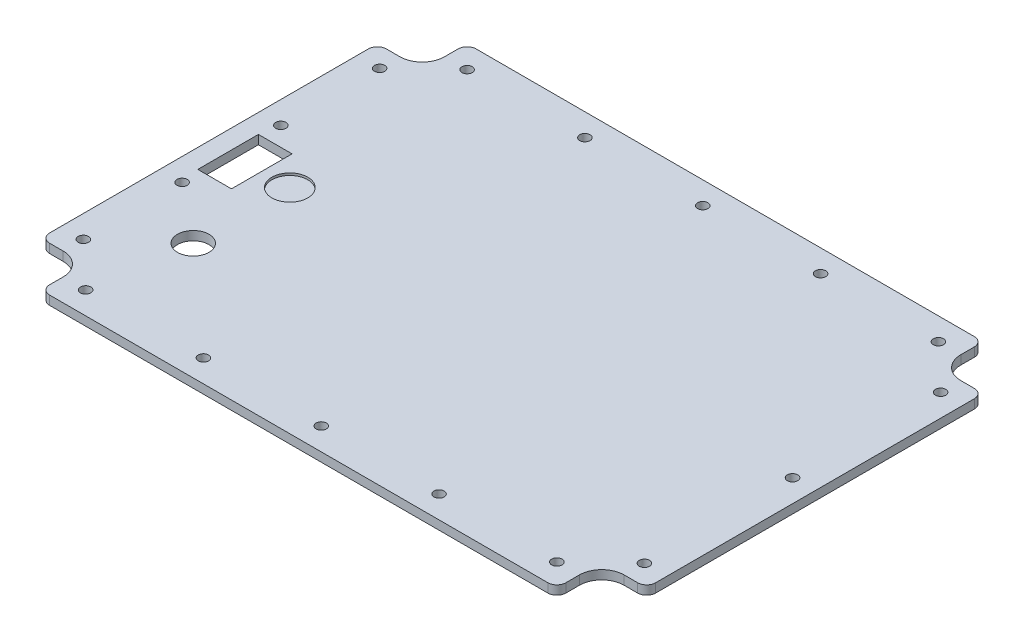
from build123d import *

# Parameters (mm, degrees)
ESQUISSE1_R             = 1.15
ESQUISSE1_R_2           = 3.5
ESQUISSE1_W             = 7.5
ESQUISSE1_H             = 13.5
BOSS_EXTRU_1_DEPTH      = 2
ESQUISSE3_R             = 4
ENL_V_MAT_EXTRU_1_DEPTH = 0.5


with BuildPart() as part:
    # Esquisse1 → Boss.-Extru.1 (new body)
    with BuildSketch(Plane(origin=(0, 0, 0), x_dir=(1, 0, 0), z_dir=(0, 1, 0))):
        with BuildLine():
            Line((-67.25, -36.072657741), (-67.25, 34.927342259))
            ThreePointArc((-67.25, 34.927342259), (-66.664213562, 36.341555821), (-65.25, 36.927342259))
            Line((-65.25, 36.927342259), (-62.25, 36.927342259))
            ThreePointArc((-62.25, 36.927342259), (-58.714466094, 38.391808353), (-57.25, 41.927342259))
            Line((-57.25, 41.927342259), (-57.25, 44.927342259))
            ThreePointArc((-57.25, 44.927342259), (-56.664213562, 46.341555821), (-55.25, 46.927342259))
            Line((-55.25, 46.927342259), (55.75, 46.927342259))
            ThreePointArc((55.75, 46.927342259), (57.164213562, 46.341555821), (57.75, 44.927342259))
            Line((57.75, 44.927342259), (57.75, 41.927342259))
            ThreePointArc((57.75, 41.927342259), (59.214466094, 38.391808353), (62.75, 36.927342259))
            Line((62.75, 36.927342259), (65.75, 36.927342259))
            ThreePointArc((65.75, 36.927342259), (67.164213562, 36.341555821), (67.75, 34.927342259))
            Line((67.75, 34.927342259), (67.75, -36.072657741))
            ThreePointArc((67.75, -36.072657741), (67.164213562, -37.486871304), (65.75, -38.072657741))
            Line((65.75, -38.072657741), (62.75, -38.072657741))
            ThreePointArc((62.75, -38.072657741), (59.214466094, -39.537123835), (57.75, -43.072657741))
            Line((57.75, -43.072657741), (57.75, -46.072657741))
            ThreePointArc((57.75, -46.072657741), (57.164213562, -47.486871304), (55.75, -48.072657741))
            Line((55.75, -48.072657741), (-55.25, -48.072657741))
            ThreePointArc((-55.25, -48.072657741), (-56.664213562, -47.486871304), (-57.25, -46.072657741))
            Line((-57.25, -46.072657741), (-57.25, -43.072657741))
            ThreePointArc((-57.25, -43.072657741), (-58.714466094, -39.537123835), (-62.25, -38.072657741))
            Line((-62.25, -38.072657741), (-65.25, -38.072657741))
            ThreePointArc((-65.25, -38.072657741), (-66.664213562, -37.486871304), (-67.25, -36.072657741))
        make_face()
        with Locations(Location((0.25, 41.927342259, 0), (0, 0, 270))):
            Circle(ESQUISSE1_R, mode=Mode.SUBTRACT)
        with Locations(Location((62.75, -0.572657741, 0), (0, 0, 270))):
            Circle(ESQUISSE1_R, mode=Mode.SUBTRACT)
        with Locations(Location((52.75, 41.927342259, 0), (0, 0, 90))):
            Circle(ESQUISSE1_R, mode=Mode.SUBTRACT)
        with Locations(Location((26.5, 41.927342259, 0), (0, 0, 90))):
            Circle(ESQUISSE1_R, mode=Mode.SUBTRACT)
        with Locations(Location((-52.25, -43.072657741, 0), (0, 0, 90))):
            Circle(ESQUISSE1_R, mode=Mode.SUBTRACT)
        with Locations(Location((-26, -43.072657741, 0), (0, 0, 90))):
            Circle(ESQUISSE1_R, mode=Mode.SUBTRACT)
        with Locations(Location((26.5, -43.072657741, 0), (0, 0, 270))):
            Circle(ESQUISSE1_R, mode=Mode.SUBTRACT)
        with Locations(Location((52.75, -43.072657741, 0), (0, 0, 270))):
            Circle(ESQUISSE1_R, mode=Mode.SUBTRACT)
        with Locations(Location((0.25, -43.072657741, 0), (0, 0, 90))):
            Circle(ESQUISSE1_R, mode=Mode.SUBTRACT)
        with Locations(Location((-62.25, 32.427342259, 0), (0, 0, 270))):
            Circle(ESQUISSE1_R, mode=Mode.SUBTRACT)
        with Locations(Location((-62.25, 10.427342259, 0), (0, 0, 270))):
            Circle(ESQUISSE1_R, mode=Mode.SUBTRACT)
        with Locations(Location((-62.25, -11.572657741, 0), (0, 0, 90))):
            Circle(ESQUISSE1_R, mode=Mode.SUBTRACT)
        with Locations(Location((-62.25, -33.572657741, 0), (0, 0, 90))):
            Circle(ESQUISSE1_R, mode=Mode.SUBTRACT)
        with Locations(Location((62.75, -33.572657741, 0), (0, 0, 270))):
            Circle(ESQUISSE1_R, mode=Mode.SUBTRACT)
        with Locations(Location((62.75, 32.427342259, 0), (0, 0, 90))):
            Circle(ESQUISSE1_R, mode=Mode.SUBTRACT)
        with Locations(Location((-26, 41.927342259, 0), (0, 0, 270))):
            Circle(ESQUISSE1_R, mode=Mode.SUBTRACT)
        with Locations(Location((-52.25, 41.927342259, 0), (0, 0, 270))):
            Circle(ESQUISSE1_R, mode=Mode.SUBTRACT)
        with Locations(Location((-49.25, -22.092657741, 0), (0, 0, 270))):
            Circle(ESQUISSE1_R_2, mode=Mode.SUBTRACT)
        with Locations((-59.25, -0.572657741)):
            Rectangle(ESQUISSE1_W, ESQUISSE1_H, mode=Mode.SUBTRACT)
    extrude(amount=BOSS_EXTRU_1_DEPTH)

    # Esquisse3 → Enl_v. mat.-Extru.1 (cut)
    with BuildSketch(Plane(origin=(0, 2, 0), x_dir=(1, 0, 0), z_dir=(0, 1, 0))):
        with Locations(Location((-49.25, -0.572657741, 0), (0, 0, 270))):
            Circle(ESQUISSE3_R)
    extrude(amount=-ENL_V_MAT_EXTRU_1_DEPTH, mode=Mode.SUBTRACT)


solid = part.part
